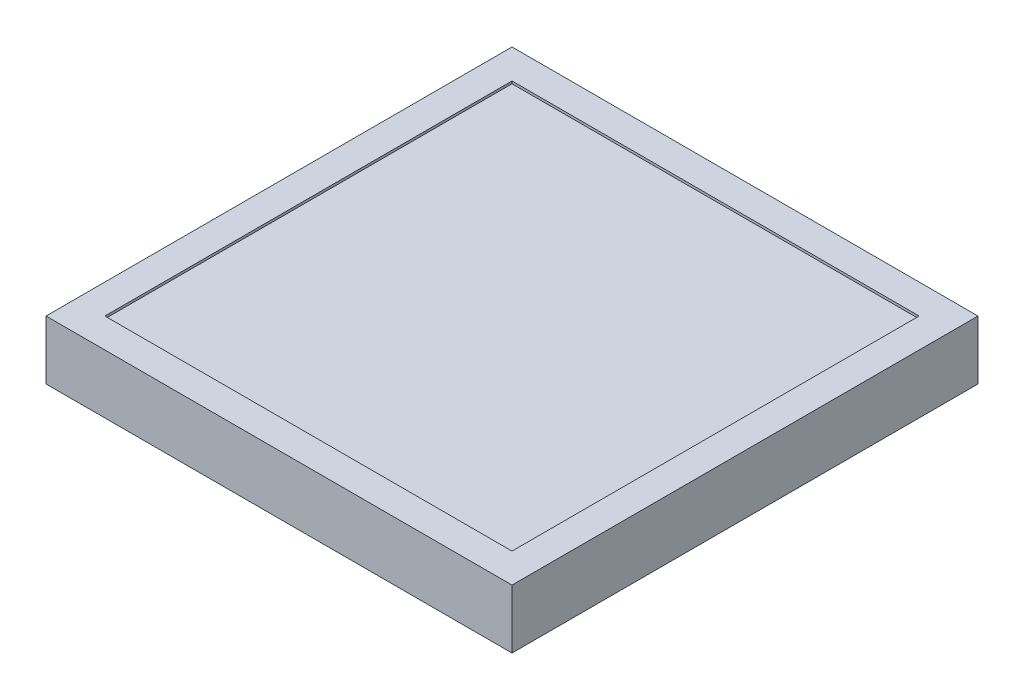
ISO-10303-21;
HEADER;
FILE_DESCRIPTION(('STEP AP214'),'2;1');
FILE_NAME('part.step','',(''),(''),'','','');
FILE_SCHEMA(('AUTOMOTIVE_DESIGN { 1 0 10303 214 1 1 1 1 }'));
ENDSEC;
DATA;
#1=APPLICATION_CONTEXT('core data for automotive mechanical design processes');
#2=APPLICATION_PROTOCOL_DEFINITION('international standard','automotive_design',2000,#1);
#3=PRODUCT_CONTEXT('',#1,'mechanical');
#4=PRODUCT('Part','Part','',(#3));
#5=PRODUCT_RELATED_PRODUCT_CATEGORY('part','',(#4));
#6=PRODUCT_DEFINITION_FORMATION('','',#4);
#7=PRODUCT_DEFINITION_CONTEXT('part definition',#1,'design');
#8=PRODUCT_DEFINITION('design','',#6,#7);
#9=PRODUCT_DEFINITION_SHAPE('','',#8);
#10=(LENGTH_UNIT() NAMED_UNIT(*) SI_UNIT(.MILLI.,.METRE.));
#11=(NAMED_UNIT(*) PLANE_ANGLE_UNIT() SI_UNIT($,.RADIAN.));
#12=(NAMED_UNIT(*) SI_UNIT($,.STERADIAN.) SOLID_ANGLE_UNIT());
#13=UNCERTAINTY_MEASURE_WITH_UNIT(LENGTH_MEASURE(1.E-05),#10,'distance_accuracy_value','');
#14=(GEOMETRIC_REPRESENTATION_CONTEXT(3) GLOBAL_UNCERTAINTY_ASSIGNED_CONTEXT((#13)) GLOBAL_UNIT_ASSIGNED_CONTEXT((#10,
#11,#12)) REPRESENTATION_CONTEXT('',''));
#15=CARTESIAN_POINT('',(0.,0.,0.));
#16=DIRECTION('',(0.,0.,1.));
#17=DIRECTION('',(1.,0.,0.));
#18=AXIS2_PLACEMENT_3D('',#15,#16,#17);
#19=CARTESIAN_POINT('',(144.143471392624,24.,145.254894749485));
#20=DIRECTION('',(-1.,0.,0.));
#21=DIRECTION('',(0.,0.,1.));
#22=AXIS2_PLACEMENT_3D('',#19,#20,#21);
#23=PLANE('',#22);
#24=DIRECTION('',(0.,0.,-1.));
#25=VECTOR('',#24,1.);
#26=CARTESIAN_POINT('',(144.143471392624,0.,145.254894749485));
#27=LINE('',#26,#25);
#28=CARTESIAN_POINT('',(144.143471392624,0.,145.254894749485));
#29=VERTEX_POINT('',#28);
#30=CARTESIAN_POINT('',(144.143471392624,0.,-44.7451052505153));
#31=VERTEX_POINT('',#30);
#32=EDGE_CURVE('E158',#29,#31,#27,.T.);
#33=ORIENTED_EDGE('',*,*,#32,.T.);
#34=DIRECTION('',(0.,-1.,0.));
#35=VECTOR('',#34,1.);
#36=CARTESIAN_POINT('',(144.143471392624,24.,-44.7451052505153));
#37=LINE('',#36,#35);
#38=CARTESIAN_POINT('',(144.143471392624,24.,-44.7451052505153));
#39=VERTEX_POINT('',#38);
#40=EDGE_CURVE('E11',#39,#31,#37,.T.);
#41=ORIENTED_EDGE('',*,*,#40,.F.);
#42=DIRECTION('',(0.,0.,-1.));
#43=VECTOR('',#42,1.);
#44=CARTESIAN_POINT('',(144.143471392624,24.,145.254894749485));
#45=LINE('',#44,#43);
#46=CARTESIAN_POINT('',(144.143471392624,24.,145.254894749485));
#47=VERTEX_POINT('',#46);
#48=EDGE_CURVE('E164',#47,#39,#45,.T.);
#49=ORIENTED_EDGE('',*,*,#48,.F.);
#50=DIRECTION('',(0.,-1.,0.));
#51=VECTOR('',#50,1.);
#52=CARTESIAN_POINT('',(144.143471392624,24.,145.254894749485));
#53=LINE('',#52,#51);
#54=EDGE_CURVE('E174',#47,#29,#53,.T.);
#55=ORIENTED_EDGE('',*,*,#54,.T.);
#56=EDGE_LOOP('',(#33,#41,#49,#55));
#57=FACE_BOUND('',#56,.T.);
#58=ADVANCED_FACE('F39',(#57),#23,.F.);
#59=CARTESIAN_POINT('',(-45.8565286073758,24.,-44.7451052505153));
#60=DIRECTION('',(0.,0.,1.));
#61=DIRECTION('',(1.,0.,0.));
#62=AXIS2_PLACEMENT_3D('',#59,#60,#61);
#63=PLANE('',#62);
#64=DIRECTION('',(-1.,0.,0.));
#65=VECTOR('',#64,1.);
#66=CARTESIAN_POINT('',(-45.8565286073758,0.,-44.7451052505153));
#67=LINE('',#66,#65);
#68=CARTESIAN_POINT('',(-45.8565286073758,0.,-44.7451052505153));
#69=VERTEX_POINT('',#68);
#70=EDGE_CURVE('E178',#31,#69,#67,.T.);
#71=ORIENTED_EDGE('',*,*,#70,.T.);
#72=DIRECTION('',(0.,-1.,0.));
#73=VECTOR('',#72,1.);
#74=CARTESIAN_POINT('',(-45.8565286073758,24.,-44.7451052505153));
#75=LINE('',#74,#73);
#76=CARTESIAN_POINT('',(-45.8565286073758,24.,-44.7451052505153));
#77=VERTEX_POINT('',#76);
#78=EDGE_CURVE('E47',#77,#69,#75,.T.);
#79=ORIENTED_EDGE('',*,*,#78,.F.);
#80=DIRECTION('',(-1.,0.,0.));
#81=VECTOR('',#80,1.);
#82=CARTESIAN_POINT('',(-45.8565286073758,24.,-44.7451052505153));
#83=LINE('',#82,#81);
#84=EDGE_CURVE('E91',#39,#77,#83,.T.);
#85=ORIENTED_EDGE('',*,*,#84,.F.);
#86=ORIENTED_EDGE('',*,*,#40,.T.);
#87=EDGE_LOOP('',(#71,#79,#85,#86));
#88=FACE_BOUND('',#87,.T.);
#89=ADVANCED_FACE('F213',(#88),#63,.F.);
#90=CARTESIAN_POINT('',(-45.8565286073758,24.,145.254894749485));
#91=DIRECTION('',(1.,0.,0.));
#92=DIRECTION('',(0.,0.,-1.));
#93=AXIS2_PLACEMENT_3D('',#90,#91,#92);
#94=PLANE('',#93);
#95=DIRECTION('',(0.,0.,1.));
#96=VECTOR('',#95,1.);
#97=CARTESIAN_POINT('',(-45.8565286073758,0.,145.254894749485));
#98=LINE('',#97,#96);
#99=CARTESIAN_POINT('',(-45.8565286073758,0.,145.254894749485));
#100=VERTEX_POINT('',#99);
#101=EDGE_CURVE('E181',#69,#100,#98,.T.);
#102=ORIENTED_EDGE('',*,*,#101,.T.);
#103=DIRECTION('',(0.,-1.,0.));
#104=VECTOR('',#103,1.);
#105=CARTESIAN_POINT('',(-45.8565286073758,24.,145.254894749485));
#106=LINE('',#105,#104);
#107=CARTESIAN_POINT('',(-45.8565286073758,24.,145.254894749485));
#108=VERTEX_POINT('',#107);
#109=EDGE_CURVE('E188',#108,#100,#106,.T.);
#110=ORIENTED_EDGE('',*,*,#109,.F.);
#111=DIRECTION('',(0.,0.,1.));
#112=VECTOR('',#111,1.);
#113=CARTESIAN_POINT('',(-45.8565286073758,24.,145.254894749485));
#114=LINE('',#113,#112);
#115=EDGE_CURVE('E169',#77,#108,#114,.T.);
#116=ORIENTED_EDGE('',*,*,#115,.F.);
#117=ORIENTED_EDGE('',*,*,#78,.T.);
#118=EDGE_LOOP('',(#102,#110,#116,#117));
#119=FACE_BOUND('',#118,.T.);
#120=ADVANCED_FACE('F195',(#119),#94,.F.);
#121=CARTESIAN_POINT('',(-45.8565286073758,24.,145.254894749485));
#122=DIRECTION('',(0.,0.,-1.));
#123=DIRECTION('',(-1.,0.,0.));
#124=AXIS2_PLACEMENT_3D('',#121,#122,#123);
#125=PLANE('',#124);
#126=DIRECTION('',(1.,0.,0.));
#127=VECTOR('',#126,1.);
#128=CARTESIAN_POINT('',(-45.8565286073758,0.,145.254894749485));
#129=LINE('',#128,#127);
#130=EDGE_CURVE('E84',#100,#29,#129,.T.);
#131=ORIENTED_EDGE('',*,*,#130,.T.);
#132=ORIENTED_EDGE('',*,*,#54,.F.);
#133=DIRECTION('',(1.,0.,0.));
#134=VECTOR('',#133,1.);
#135=CARTESIAN_POINT('',(-45.8565286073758,24.,145.254894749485));
#136=LINE('',#135,#134);
#137=EDGE_CURVE('E63',#108,#47,#136,.T.);
#138=ORIENTED_EDGE('',*,*,#137,.F.);
#139=ORIENTED_EDGE('',*,*,#109,.T.);
#140=EDGE_LOOP('',(#131,#132,#138,#139));
#141=FACE_BOUND('',#140,.T.);
#142=ADVANCED_FACE('F203',(#141),#125,.F.);
#143=CARTESIAN_POINT('',(0.,24.,0.));
#144=DIRECTION('',(0.,-1.,0.));
#145=DIRECTION('',(0.,0.,-1.));
#146=AXIS2_PLACEMENT_3D('',#143,#144,#145);
#147=PLANE('',#146);
#148=DIRECTION('',(-1.,0.,0.));
#149=VECTOR('',#148,1.);
#150=CARTESIAN_POINT('',(-33.8565286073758,24.,-32.7451052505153));
#151=LINE('',#150,#149);
#152=CARTESIAN_POINT('',(132.143471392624,24.,-32.7451052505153));
#153=VERTEX_POINT('',#152);
#154=CARTESIAN_POINT('',(-33.8565286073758,24.,-32.7451052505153));
#155=VERTEX_POINT('',#154);
#156=EDGE_CURVE('E149',#153,#155,#151,.T.);
#157=ORIENTED_EDGE('',*,*,#156,.F.);
#158=DIRECTION('',(0.,0.,-1.));
#159=VECTOR('',#158,1.);
#160=CARTESIAN_POINT('',(132.143471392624,24.,133.254894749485));
#161=LINE('',#160,#159);
#162=CARTESIAN_POINT('',(132.143471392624,24.,133.254894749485));
#163=VERTEX_POINT('',#162);
#164=EDGE_CURVE('E54',#163,#153,#161,.T.);
#165=ORIENTED_EDGE('',*,*,#164,.F.);
#166=DIRECTION('',(1.,0.,0.));
#167=VECTOR('',#166,1.);
#168=CARTESIAN_POINT('',(-33.8565286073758,24.,133.254894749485));
#169=LINE('',#168,#167);
#170=CARTESIAN_POINT('',(-33.8565286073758,24.,133.254894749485));
#171=VERTEX_POINT('',#170);
#172=EDGE_CURVE('E136',#171,#163,#169,.T.);
#173=ORIENTED_EDGE('',*,*,#172,.F.);
#174=DIRECTION('',(0.,0.,1.));
#175=VECTOR('',#174,1.);
#176=CARTESIAN_POINT('',(-33.8565286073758,24.,133.254894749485));
#177=LINE('',#176,#175);
#178=EDGE_CURVE('E140',#155,#171,#177,.T.);
#179=ORIENTED_EDGE('',*,*,#178,.F.);
#180=EDGE_LOOP('',(#157,#165,#173,#179));
#181=FACE_BOUND('',#180,.T.);
#182=ORIENTED_EDGE('',*,*,#48,.T.);
#183=ORIENTED_EDGE('',*,*,#84,.T.);
#184=ORIENTED_EDGE('',*,*,#115,.T.);
#185=ORIENTED_EDGE('',*,*,#137,.T.);
#186=EDGE_LOOP('',(#182,#183,#184,#185));
#187=FACE_BOUND('',#186,.T.);
#188=ADVANCED_FACE('F205',(#181,#187),#147,.F.);
#189=CARTESIAN_POINT('',(0.,0.,0.));
#190=DIRECTION('',(0.,-1.,0.));
#191=DIRECTION('',(0.,0.,-1.));
#192=AXIS2_PLACEMENT_3D('',#189,#190,#191);
#193=PLANE('',#192);
#194=ORIENTED_EDGE('',*,*,#32,.F.);
#195=ORIENTED_EDGE('',*,*,#130,.F.);
#196=ORIENTED_EDGE('',*,*,#101,.F.);
#197=ORIENTED_EDGE('',*,*,#70,.F.);
#198=EDGE_LOOP('',(#194,#195,#196,#197));
#199=FACE_BOUND('',#198,.T.);
#200=ADVANCED_FACE('F199',(#199),#193,.T.);
#201=CARTESIAN_POINT('',(132.143471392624,23.,133.254894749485));
#202=DIRECTION('',(1.,0.,0.));
#203=DIRECTION('',(0.,0.,-1.));
#204=AXIS2_PLACEMENT_3D('',#201,#202,#203);
#205=PLANE('',#204);
#206=ORIENTED_EDGE('',*,*,#164,.T.);
#207=DIRECTION('',(0.,1.,0.));
#208=VECTOR('',#207,1.);
#209=CARTESIAN_POINT('',(132.143471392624,23.,-32.7451052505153));
#210=LINE('',#209,#208);
#211=CARTESIAN_POINT('',(132.143471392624,23.,-32.7451052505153));
#212=VERTEX_POINT('',#211);
#213=EDGE_CURVE('E111',#212,#153,#210,.T.);
#214=ORIENTED_EDGE('',*,*,#213,.F.);
#215=DIRECTION('',(0.,0.,-1.));
#216=VECTOR('',#215,1.);
#217=CARTESIAN_POINT('',(132.143471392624,23.,133.254894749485));
#218=LINE('',#217,#216);
#219=CARTESIAN_POINT('',(132.143471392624,23.,133.254894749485));
#220=VERTEX_POINT('',#219);
#221=EDGE_CURVE('E115',#220,#212,#218,.T.);
#222=ORIENTED_EDGE('',*,*,#221,.F.);
#223=DIRECTION('',(0.,1.,0.));
#224=VECTOR('',#223,1.);
#225=CARTESIAN_POINT('',(132.143471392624,23.,133.254894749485));
#226=LINE('',#225,#224);
#227=EDGE_CURVE('E155',#220,#163,#226,.T.);
#228=ORIENTED_EDGE('',*,*,#227,.T.);
#229=EDGE_LOOP('',(#206,#214,#222,#228));
#230=FACE_BOUND('',#229,.T.);
#231=ADVANCED_FACE('F113',(#230),#205,.F.);
#232=CARTESIAN_POINT('',(-33.8565286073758,23.,133.254894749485));
#233=DIRECTION('',(0.,0.,1.));
#234=DIRECTION('',(1.,0.,0.));
#235=AXIS2_PLACEMENT_3D('',#232,#233,#234);
#236=PLANE('',#235);
#237=ORIENTED_EDGE('',*,*,#172,.T.);
#238=ORIENTED_EDGE('',*,*,#227,.F.);
#239=DIRECTION('',(1.,0.,0.));
#240=VECTOR('',#239,1.);
#241=CARTESIAN_POINT('',(-33.8565286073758,23.,133.254894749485));
#242=LINE('',#241,#240);
#243=CARTESIAN_POINT('',(-33.8565286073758,23.,133.254894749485));
#244=VERTEX_POINT('',#243);
#245=EDGE_CURVE('E122',#244,#220,#242,.T.);
#246=ORIENTED_EDGE('',*,*,#245,.F.);
#247=DIRECTION('',(0.,1.,0.));
#248=VECTOR('',#247,1.);
#249=CARTESIAN_POINT('',(-33.8565286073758,23.,133.254894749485));
#250=LINE('',#249,#248);
#251=EDGE_CURVE('E159',#244,#171,#250,.T.);
#252=ORIENTED_EDGE('',*,*,#251,.T.);
#253=EDGE_LOOP('',(#237,#238,#246,#252));
#254=FACE_BOUND('',#253,.T.);
#255=ADVANCED_FACE('F252',(#254),#236,.F.);
#256=CARTESIAN_POINT('',(-33.8565286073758,23.,133.254894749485));
#257=DIRECTION('',(-1.,0.,0.));
#258=DIRECTION('',(0.,0.,1.));
#259=AXIS2_PLACEMENT_3D('',#256,#257,#258);
#260=PLANE('',#259);
#261=ORIENTED_EDGE('',*,*,#178,.T.);
#262=ORIENTED_EDGE('',*,*,#251,.F.);
#263=DIRECTION('',(0.,0.,1.));
#264=VECTOR('',#263,1.);
#265=CARTESIAN_POINT('',(-33.8565286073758,23.,133.254894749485));
#266=LINE('',#265,#264);
#267=CARTESIAN_POINT('',(-33.8565286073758,23.,-32.7451052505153));
#268=VERTEX_POINT('',#267);
#269=EDGE_CURVE('E131',#268,#244,#266,.T.);
#270=ORIENTED_EDGE('',*,*,#269,.F.);
#271=DIRECTION('',(0.,1.,0.));
#272=VECTOR('',#271,1.);
#273=CARTESIAN_POINT('',(-33.8565286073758,23.,-32.7451052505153));
#274=LINE('',#273,#272);
#275=EDGE_CURVE('E121',#268,#155,#274,.T.);
#276=ORIENTED_EDGE('',*,*,#275,.T.);
#277=EDGE_LOOP('',(#261,#262,#270,#276));
#278=FACE_BOUND('',#277,.T.);
#279=ADVANCED_FACE('F261',(#278),#260,.F.);
#280=CARTESIAN_POINT('',(-33.8565286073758,23.,-32.7451052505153));
#281=DIRECTION('',(0.,0.,-1.));
#282=DIRECTION('',(-1.,0.,0.));
#283=AXIS2_PLACEMENT_3D('',#280,#281,#282);
#284=PLANE('',#283);
#285=ORIENTED_EDGE('',*,*,#156,.T.);
#286=ORIENTED_EDGE('',*,*,#275,.F.);
#287=DIRECTION('',(-1.,0.,0.));
#288=VECTOR('',#287,1.);
#289=CARTESIAN_POINT('',(-33.8565286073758,23.,-32.7451052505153));
#290=LINE('',#289,#288);
#291=EDGE_CURVE('E125',#212,#268,#290,.T.);
#292=ORIENTED_EDGE('',*,*,#291,.F.);
#293=ORIENTED_EDGE('',*,*,#213,.T.);
#294=EDGE_LOOP('',(#285,#286,#292,#293));
#295=FACE_BOUND('',#294,.T.);
#296=ADVANCED_FACE('F126',(#295),#284,.F.);
#297=CARTESIAN_POINT('',(0.,23.,0.));
#298=DIRECTION('',(0.,-1.,0.));
#299=DIRECTION('',(0.,0.,-1.));
#300=AXIS2_PLACEMENT_3D('',#297,#298,#299);
#301=PLANE('',#300);
#302=ORIENTED_EDGE('',*,*,#221,.T.);
#303=ORIENTED_EDGE('',*,*,#291,.T.);
#304=ORIENTED_EDGE('',*,*,#269,.T.);
#305=ORIENTED_EDGE('',*,*,#245,.T.);
#306=EDGE_LOOP('',(#302,#303,#304,#305));
#307=FACE_BOUND('',#306,.T.);
#308=ADVANCED_FACE('F133',(#307),#301,.F.);
#309=CLOSED_SHELL('',(#58,#89,#120,#142,#188,#200,#231,#255,#279,#296,#308));
#310=MANIFOLD_SOLID_BREP('B2',#309);
#311=ADVANCED_BREP_SHAPE_REPRESENTATION('',(#18,#310),#14);
#312=SHAPE_DEFINITION_REPRESENTATION(#9,#311);
ENDSEC;
END-ISO-10303-21;
